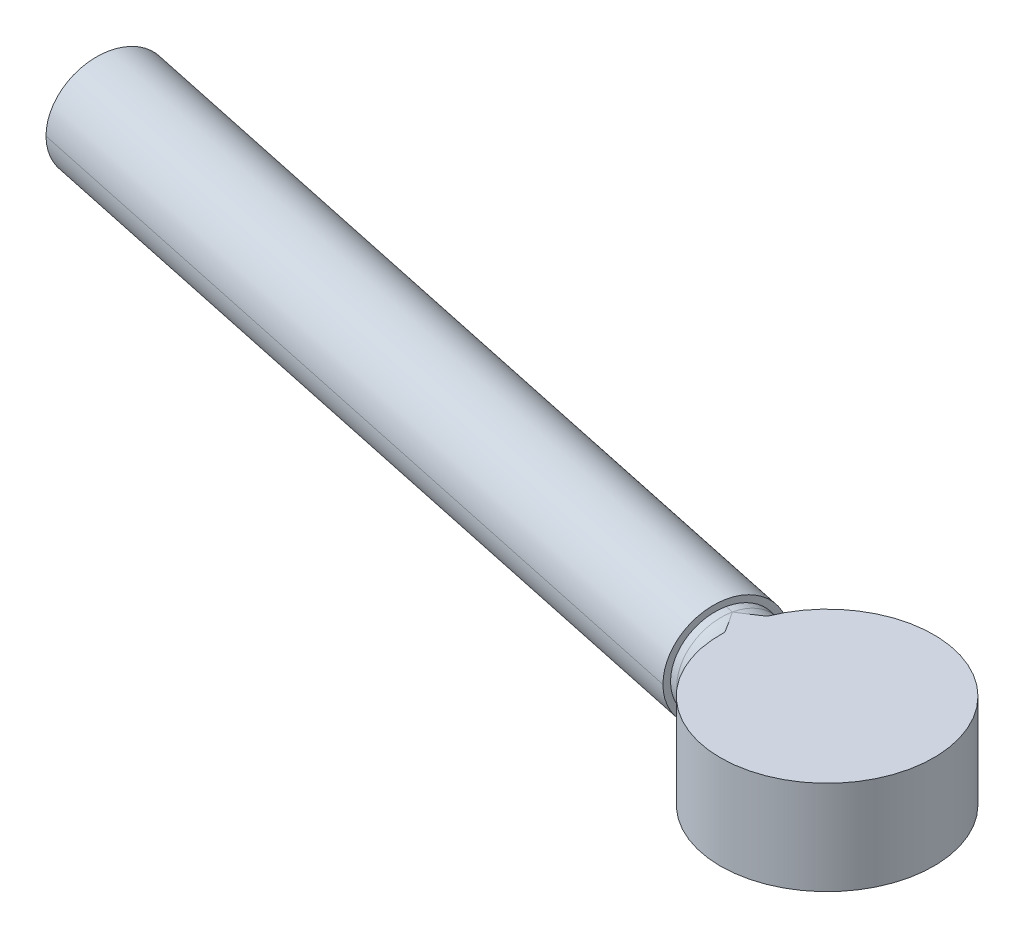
ISO-10303-21;
HEADER;
FILE_DESCRIPTION(('STEP AP214'),'2;1');
FILE_NAME('part.step','',(''),(''),'','','');
FILE_SCHEMA(('AUTOMOTIVE_DESIGN { 1 0 10303 214 1 1 1 1 }'));
ENDSEC;
DATA;
#1=APPLICATION_CONTEXT('core data for automotive mechanical design processes');
#2=APPLICATION_PROTOCOL_DEFINITION('international standard','automotive_design',2000,#1);
#3=PRODUCT_CONTEXT('',#1,'mechanical');
#4=PRODUCT('Part','Part','',(#3));
#5=PRODUCT_RELATED_PRODUCT_CATEGORY('part','',(#4));
#6=PRODUCT_DEFINITION_FORMATION('','',#4);
#7=PRODUCT_DEFINITION_CONTEXT('part definition',#1,'design');
#8=PRODUCT_DEFINITION('design','',#6,#7);
#9=PRODUCT_DEFINITION_SHAPE('','',#8);
#10=(LENGTH_UNIT() NAMED_UNIT(*) SI_UNIT(.MILLI.,.METRE.));
#11=(NAMED_UNIT(*) PLANE_ANGLE_UNIT() SI_UNIT($,.RADIAN.));
#12=(NAMED_UNIT(*) SI_UNIT($,.STERADIAN.) SOLID_ANGLE_UNIT());
#13=UNCERTAINTY_MEASURE_WITH_UNIT(LENGTH_MEASURE(1.E-05),#10,'distance_accuracy_value','');
#14=(GEOMETRIC_REPRESENTATION_CONTEXT(3) GLOBAL_UNCERTAINTY_ASSIGNED_CONTEXT((#13)) GLOBAL_UNIT_ASSIGNED_CONTEXT((#10,
#11,#12)) REPRESENTATION_CONTEXT('',''));
#15=CARTESIAN_POINT('',(0.,0.,0.));
#16=DIRECTION('',(0.,0.,1.));
#17=DIRECTION('',(1.,0.,0.));
#18=AXIS2_PLACEMENT_3D('',#15,#16,#17);
#19=CARTESIAN_POINT('',(-457.741621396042,-209.999999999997,614.766894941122));
#20=DIRECTION('',(-0.978172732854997,0.,-0.207793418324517));
#21=DIRECTION('',(-0.207793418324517,0.,0.978172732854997));
#22=AXIS2_PLACEMENT_3D('',#19,#20,#21);
#23=PLANE('',#22);
#24=CARTESIAN_POINT('',(-457.741621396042,-209.999999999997,614.766894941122));
#25=DIRECTION('',(-0.978172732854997,0.,-0.207793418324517));
#26=DIRECTION('',(-0.207793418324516,0.,0.978172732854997));
#27=AXIS2_PLACEMENT_3D('',#24,#25,#26);
#28=CIRCLE('',#27,37.5);
#29=CARTESIAN_POINT('',(-465.533874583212,-209.999999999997,651.448372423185));
#30=VERTEX_POINT('',#29);
#31=CARTESIAN_POINT('',(-449.949368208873,-209.999999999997,578.08541745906));
#32=VERTEX_POINT('',#31);
#33=EDGE_CURVE('E10',#30,#32,#28,.T.);
#34=ORIENTED_EDGE('',*,*,#33,.T.);
#35=CARTESIAN_POINT('',(-457.741621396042,-209.999999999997,614.766894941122));
#36=DIRECTION('',(-0.978172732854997,0.,-0.207793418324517));
#37=DIRECTION('',(-0.207793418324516,0.,0.978172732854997));
#38=AXIS2_PLACEMENT_3D('',#35,#36,#37);
#39=CIRCLE('',#38,37.5);
#40=EDGE_CURVE('E31',#32,#30,#39,.T.);
#41=ORIENTED_EDGE('',*,*,#40,.T.);
#42=EDGE_LOOP('',(#34,#41));
#43=FACE_BOUND('',#42,.T.);
#44=ADVANCED_FACE('F16',(#43),#23,.T.);
#45=CARTESIAN_POINT('',(-457.741621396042,-209.999999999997,614.766894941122));
#46=DIRECTION('',(0.978172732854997,0.,0.207793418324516));
#47=DIRECTION('',(0.207793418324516,0.,-0.978172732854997));
#48=AXIS2_PLACEMENT_3D('',#45,#46,#47);
#49=CYLINDRICAL_SURFACE('',#48,37.5);
#50=DIRECTION('',(0.978172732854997,0.,0.207793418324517));
#51=VECTOR('',#50,1.);
#52=CARTESIAN_POINT('',(-553.700254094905,-209.999999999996,556.04559718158));
#53=LINE('',#52,#51);
#54=CARTESIAN_POINT('',(100.76188038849,-210.000000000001,695.073111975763));
#55=VERTEX_POINT('',#54);
#56=EDGE_CURVE('E40',#32,#55,#53,.T.);
#57=ORIENTED_EDGE('',*,*,#56,.F.);
#58=ORIENTED_EDGE('',*,*,#33,.F.);
#59=DIRECTION('',(0.978172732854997,0.,0.207793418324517));
#60=VECTOR('',#59,1.);
#61=CARTESIAN_POINT('',(-569.284760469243,-209.999999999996,629.408552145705));
#62=LINE('',#61,#60);
#63=CARTESIAN_POINT('',(85.1773740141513,-210.000000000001,768.436066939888));
#64=VERTEX_POINT('',#63);
#65=EDGE_CURVE('E207',#30,#64,#62,.T.);
#66=ORIENTED_EDGE('',*,*,#65,.T.);
#67=CARTESIAN_POINT('',(92.9696272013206,-210.000000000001,731.754589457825));
#68=DIRECTION('',(0.978172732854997,0.,0.207793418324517));
#69=DIRECTION('',(-0.207793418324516,0.,0.978172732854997));
#70=AXIS2_PLACEMENT_3D('',#67,#68,#69);
#71=CIRCLE('',#70,37.5);
#72=EDGE_CURVE('E117',#55,#64,#71,.T.);
#73=ORIENTED_EDGE('',*,*,#72,.F.);
#74=EDGE_LOOP('',(#57,#58,#66,#73));
#75=FACE_BOUND('',#74,.T.);
#76=ADVANCED_FACE('F187',(#75),#49,.T.);
#77=CARTESIAN_POINT('',(-457.741621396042,-209.999999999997,614.766894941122));
#78=DIRECTION('',(0.978172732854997,0.,0.207793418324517));
#79=DIRECTION('',(0.207793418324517,0.,-0.978172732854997));
#80=AXIS2_PLACEMENT_3D('',#77,#78,#79);
#81=CYLINDRICAL_SURFACE('',#80,37.5);
#82=ORIENTED_EDGE('',*,*,#40,.F.);
#83=ORIENTED_EDGE('',*,*,#56,.T.);
#84=CARTESIAN_POINT('',(92.9696272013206,-210.000000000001,731.754589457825));
#85=DIRECTION('',(0.978172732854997,0.,0.207793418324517));
#86=DIRECTION('',(-0.207793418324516,0.,0.978172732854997));
#87=AXIS2_PLACEMENT_3D('',#84,#85,#86);
#88=CIRCLE('',#87,37.5);
#89=EDGE_CURVE('E128',#64,#55,#88,.T.);
#90=ORIENTED_EDGE('',*,*,#89,.F.);
#91=ORIENTED_EDGE('',*,*,#65,.F.);
#92=EDGE_LOOP('',(#82,#83,#90,#91));
#93=FACE_BOUND('',#92,.T.);
#94=ADVANCED_FACE('F184',(#93),#81,.T.);
#95=CARTESIAN_POINT('',(92.9696272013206,-210.000000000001,731.754589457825));
#96=DIRECTION('',(0.978172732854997,0.,0.207793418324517));
#97=DIRECTION('',(0.207793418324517,0.,-0.978172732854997));
#98=AXIS2_PLACEMENT_3D('',#95,#96,#97);
#99=PLANE('',#98);
#100=ORIENTED_EDGE('',*,*,#89,.T.);
#101=ORIENTED_EDGE('',*,*,#72,.T.);
#102=EDGE_LOOP('',(#100,#101));
#103=FACE_BOUND('',#102,.T.);
#104=CARTESIAN_POINT('',(92.9696272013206,-210.000000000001,731.754589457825));
#105=DIRECTION('',(0.978172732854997,0.,0.207793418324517));
#106=DIRECTION('',(-0.207793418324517,0.,0.978172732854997));
#107=AXIS2_PLACEMENT_3D('',#104,#105,#106);
#108=CIRCLE('',#107,33.);
#109=CARTESIAN_POINT('',(92.9696272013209,-177.000000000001,731.754589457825));
#110=VERTEX_POINT('',#109);
#111=CARTESIAN_POINT('',(92.9696272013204,-243.000000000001,731.754589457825));
#112=VERTEX_POINT('',#111);
#113=EDGE_CURVE('E113',#110,#112,#108,.T.);
#114=ORIENTED_EDGE('',*,*,#113,.F.);
#115=CARTESIAN_POINT('',(92.9696272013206,-210.000000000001,731.754589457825));
#116=DIRECTION('',(0.978172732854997,0.,0.207793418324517));
#117=DIRECTION('',(-0.207793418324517,0.,0.978172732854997));
#118=AXIS2_PLACEMENT_3D('',#115,#116,#117);
#119=CIRCLE('',#118,33.);
#120=EDGE_CURVE('E109',#112,#110,#119,.T.);
#121=ORIENTED_EDGE('',*,*,#120,.F.);
#122=EDGE_LOOP('',(#114,#121));
#123=FACE_BOUND('',#122,.T.);
#124=ADVANCED_FACE('F183',(#103,#123),#99,.T.);
#125=CARTESIAN_POINT('',(98.4827404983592,-210.000000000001,732.92574115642));
#126=DIRECTION('',(-0.978172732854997,0.,-0.207793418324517));
#127=DIRECTION('',(-0.207793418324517,0.,0.978172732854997));
#128=AXIS2_PLACEMENT_3D('',#125,#126,#127);
#129=CYLINDRICAL_SURFACE('',#128,33.);
#130=DIRECTION('',(-0.978172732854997,0.,-0.207793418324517));
#131=VECTOR('',#130,1.);
#132=CARTESIAN_POINT('',(40.2461169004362,-243.,720.554524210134));
#133=LINE('',#132,#131);
#134=CARTESIAN_POINT('',(98.482740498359,-243.000000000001,732.92574115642));
#135=VERTEX_POINT('',#134);
#136=EDGE_CURVE('E116',#135,#112,#133,.T.);
#137=ORIENTED_EDGE('',*,*,#136,.F.);
#138=CARTESIAN_POINT('',(98.4827404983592,-210.000000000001,732.92574115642));
#139=DIRECTION('',(-0.978172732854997,0.,-0.207793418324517));
#140=DIRECTION('',(0.,1.,0.));
#141=AXIS2_PLACEMENT_3D('',#138,#139,#140);
#142=CIRCLE('',#141,33.);
#143=CARTESIAN_POINT('',(98.4827404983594,-177.000000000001,732.92574115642));
#144=VERTEX_POINT('',#143);
#145=EDGE_CURVE('E86',#135,#144,#142,.T.);
#146=ORIENTED_EDGE('',*,*,#145,.T.);
#147=DIRECTION('',(-0.978172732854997,0.,-0.207793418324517));
#148=VECTOR('',#147,1.);
#149=CARTESIAN_POINT('',(40.2461169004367,-177.,720.554524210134));
#150=LINE('',#149,#148);
#151=EDGE_CURVE('E103',#144,#110,#150,.T.);
#152=ORIENTED_EDGE('',*,*,#151,.T.);
#153=ORIENTED_EDGE('',*,*,#113,.T.);
#154=EDGE_LOOP('',(#137,#146,#152,#153));
#155=FACE_BOUND('',#154,.T.);
#156=ADVANCED_FACE('F115',(#155),#129,.T.);
#157=CARTESIAN_POINT('',(98.4827404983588,-210.000000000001,732.92574115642));
#158=DIRECTION('',(-0.978172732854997,0.,-0.207793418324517));
#159=DIRECTION('',(-0.207793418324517,0.,0.978172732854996));
#160=AXIS2_PLACEMENT_3D('',#157,#158,#159);
#161=TOROIDAL_SURFACE('',#160,67.9999999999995,35.0000000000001);
#162=CARTESIAN_POINT('',(111.098486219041,-244.53681765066,729.758596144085));
#163=CARTESIAN_POINT('',(110.941768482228,-244.613444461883,730.292168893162));
#164=CARTESIAN_POINT('',(110.79058248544,-244.679027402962,730.828962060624));
#165=CARTESIAN_POINT('',(110.499691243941,-244.787855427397,731.907907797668));
#166=CARTESIAN_POINT('',(110.359986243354,-244.83110003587,732.450060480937));
#167=CARTESIAN_POINT('',(110.092514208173,-244.894990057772,733.538485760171));
#168=CARTESIAN_POINT('',(109.96474421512,-244.915641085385,734.084757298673));
#169=CARTESIAN_POINT('',(109.721427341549,-244.934259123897,735.180392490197));
#170=CARTESIAN_POINT('',(109.605880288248,-244.932226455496,735.729756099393));
#171=CARTESIAN_POINT('',(109.388052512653,-244.905585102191,736.82636816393));
#172=CARTESIAN_POINT('',(109.285680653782,-244.881142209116,737.373602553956));
#173=CARTESIAN_POINT('',(109.093367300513,-244.810043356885,738.468812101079));
#174=CARTESIAN_POINT('',(109.003425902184,-244.763387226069,739.01678726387));
#175=CARTESIAN_POINT('',(108.836042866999,-244.648103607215,740.112300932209));
#176=CARTESIAN_POINT('',(108.758600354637,-244.579477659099,740.659839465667));
#177=CARTESIAN_POINT('',(108.616185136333,-244.420615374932,741.7533541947));
#178=CARTESIAN_POINT('',(108.551212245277,-244.330379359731,742.299330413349));
#179=CARTESIAN_POINT('',(108.383713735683,-244.043074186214,743.851282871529));
#180=CARTESIAN_POINT('',(108.296136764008,-243.820344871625,744.854269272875));
#181=CARTESIAN_POINT('',(108.161979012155,-243.30596798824,746.844924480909));
#182=CARTESIAN_POINT('',(108.115396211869,-243.014323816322,747.832594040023));
#183=CARTESIAN_POINT('',(108.061066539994,-242.365895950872,749.788726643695));
#184=CARTESIAN_POINT('',(108.053368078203,-242.009031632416,750.757164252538));
#185=CARTESIAN_POINT('',(108.074287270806,-241.235006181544,752.669203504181));
#186=CARTESIAN_POINT('',(108.102909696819,-240.817837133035,753.612801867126));
#187=CARTESIAN_POINT('',(108.211394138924,-239.751974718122,755.839135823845));
#188=CARTESIAN_POINT('',(108.307033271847,-239.076929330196,757.10855893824));
#189=CARTESIAN_POINT('',(108.554477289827,-237.630940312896,759.585890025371));
#190=CARTESIAN_POINT('',(108.706302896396,-236.859961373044,760.793775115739));
#191=CARTESIAN_POINT('',(109.057483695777,-235.232479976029,763.145590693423));
#192=CARTESIAN_POINT('',(109.256908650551,-234.375853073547,764.289424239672));
#193=CARTESIAN_POINT('',(109.69451192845,-232.588287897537,766.509095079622));
#194=CARTESIAN_POINT('',(109.932685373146,-231.657358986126,767.584940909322));
#195=CARTESIAN_POINT('',(110.418630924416,-229.809779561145,769.581786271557));
#196=CARTESIAN_POINT('',(110.663970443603,-228.898343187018,770.508228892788));
#197=CARTESIAN_POINT('',(111.174537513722,-227.02598695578,772.303736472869));
#198=CARTESIAN_POINT('',(111.439765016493,-226.0650672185,773.172801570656));
#199=CARTESIAN_POINT('',(111.984261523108,-224.099948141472,774.853012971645));
#200=CARTESIAN_POINT('',(112.263512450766,-223.095804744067,775.664230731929));
#201=CARTESIAN_POINT('',(112.831197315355,-221.047461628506,777.230593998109));
#202=CARTESIAN_POINT('',(113.119630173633,-220.003266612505,777.985746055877));
#203=CARTESIAN_POINT('',(113.704727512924,-217.864301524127,779.450522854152));
#204=CARTESIAN_POINT('',(114.001450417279,-216.769044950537,780.15941262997));
#205=CARTESIAN_POINT('',(114.594537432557,-214.544756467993,781.521151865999));
#206=CARTESIAN_POINT('',(114.890901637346,-213.415737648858,782.174022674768));
#207=CARTESIAN_POINT('',(115.373606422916,-211.53629388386,783.200856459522));
#208=CARTESIAN_POINT('',(115.561354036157,-210.795024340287,783.590997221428));
#209=CARTESIAN_POINT('',(115.751498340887,-210.031801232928,783.977935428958));
#210=CARTESIAN_POINT('',(115.755457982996,-210.015901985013,783.985989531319));
#211=CARTESIAN_POINT('',(115.759416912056,-210.000000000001,783.994038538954));
#212=B_SPLINE_CURVE_WITH_KNOTS('',3,(#162,#163,#164,#165,#166,#167,#168,#169,#170,#171,#172,
#173,#174,#175,#176,#177,#178,#179,#180,#181,#182,#183,#184,#185,#186,#187,#188,#189,#190,#191,
#192,#193,#194,#195,#196,#197,#198,#199,#200,#201,#202,#203,#204,#205,#206,#207,#208,#209,#210,
#211),.UNSPECIFIED.,.F.,.F.,(4,2,2,2,2,2,2,2,2,2,2,2,2,2,2,2,2,2,2,2,2,2,2,2,4),(0.,
1.68396774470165,3.36797128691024,5.05155628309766,6.73511747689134,8.40632324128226,
10.0775419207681,11.7486434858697,13.419720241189,16.509504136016,19.5991357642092,
22.6926129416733,25.7864965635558,30.102820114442,34.4207371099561,38.7450217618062,
43.0687624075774,47.0340620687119,50.9993521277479,54.9596559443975,58.9194962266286,
62.9317531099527,66.9424740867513,69.5174274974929,69.5721997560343),.UNSPECIFIED.);
#213=CARTESIAN_POINT('',(115.759416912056,-210.000000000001,783.994038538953));
#214=VERTEX_POINT('',#213);
#215=CARTESIAN_POINT('',(108.121452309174,-242.999999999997,747.840543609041));
#216=VERTEX_POINT('',#215);
#217=EDGE_CURVE('E21',#214,#216,#212,.F.);
#218=ORIENTED_EDGE('',*,*,#217,.F.);
#219=CARTESIAN_POINT('',(108.121452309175,-176.999999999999,747.840543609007));
#220=CARTESIAN_POINT('',(108.099957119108,-177.162193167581,748.36819737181));
#221=CARTESIAN_POINT('',(108.084168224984,-177.333903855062,748.893127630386));
#222=CARTESIAN_POINT('',(108.063609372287,-177.695642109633,749.936790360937));
#223=CARTESIAN_POINT('',(108.058838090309,-177.885667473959,750.455523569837));
#224=CARTESIAN_POINT('',(108.059915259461,-178.283145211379,751.485621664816));
#225=CARTESIAN_POINT('',(108.065752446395,-178.49057887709,751.996993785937));
#226=CARTESIAN_POINT('',(108.087583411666,-178.922318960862,753.01232849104));
#227=CARTESIAN_POINT('',(108.103577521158,-179.146625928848,753.516290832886));
#228=CARTESIAN_POINT('',(108.165861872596,-179.840967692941,755.010199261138));
#229=CARTESIAN_POINT('',(108.226472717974,-180.334913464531,755.988584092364));
#230=CARTESIAN_POINT('',(108.382227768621,-181.381176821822,757.910946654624));
#231=CARTESIAN_POINT('',(108.477385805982,-181.93351772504,758.854910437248));
#232=CARTESIAN_POINT('',(108.751839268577,-183.371681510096,761.154415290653));
#233=CARTESIAN_POINT('',(108.949563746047,-184.289467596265,762.487898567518));
#234=CARTESIAN_POINT('',(109.399782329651,-186.226214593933,765.069417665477));
#235=CARTESIAN_POINT('',(109.652297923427,-187.245215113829,766.317419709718));
#236=CARTESIAN_POINT('',(110.200819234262,-189.373973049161,768.729711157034));
#237=CARTESIAN_POINT('',(110.496952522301,-190.48399230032,769.89373955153));
#238=CARTESIAN_POINT('',(111.120753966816,-192.780423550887,772.133638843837));
#239=CARTESIAN_POINT('',(111.448414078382,-193.966816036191,773.209532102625));
#240=CARTESIAN_POINT('',(112.20678861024,-196.702140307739,775.52441459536));
#241=CARTESIAN_POINT('',(112.643260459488,-198.269354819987,776.739911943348));
#242=CARTESIAN_POINT('',(113.529865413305,-201.490134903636,779.037815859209));
#243=CARTESIAN_POINT('',(113.97997245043,-203.143539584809,780.120458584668));
#244=CARTESIAN_POINT('',(114.613399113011,-205.530440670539,781.557696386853));
#245=CARTESIAN_POINT('',(114.797702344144,-206.232152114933,781.965514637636));
#246=CARTESIAN_POINT('',(115.164875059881,-207.647975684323,782.759802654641));
#247=CARTESIAN_POINT('',(115.347744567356,-208.362087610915,783.146272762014));
#248=CARTESIAN_POINT('',(115.602294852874,-209.371178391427,783.673084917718));
#249=CARTESIAN_POINT('',(115.675034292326,-209.661278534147,783.822333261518));
#250=CARTESIAN_POINT('',(115.751498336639,-209.968198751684,783.977935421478));
#251=CARTESIAN_POINT('',(115.755457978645,-209.984097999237,783.985989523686));
#252=CARTESIAN_POINT('',(115.759416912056,-210.000000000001,783.994038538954));
#253=B_SPLINE_CURVE_WITH_KNOTS('',3,(#219,#220,#221,#222,#223,#224,#225,#226,#227,#228,#229,
#230,#231,#232,#233,#234,#235,#236,#237,#238,#239,#240,#241,#242,#243,#244,#245,#246,#247,#248,
#249,#250,#251,#252),.UNSPECIFIED.,.F.,.F.,(4,2,2,2,2,2,2,2,2,2,2,2,2,2,2,2,4),(0.,
1.65715034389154,3.31410162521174,4.96929456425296,6.62454147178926,9.91443625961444,
13.2056497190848,18.090675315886,22.9776201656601,27.8791528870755,32.7794381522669,
38.8649413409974,44.9394654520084,47.4360349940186,49.9325646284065,50.9353032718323,
50.9900755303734),.UNSPECIFIED.);
#254=CARTESIAN_POINT('',(108.121452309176,-177.,747.840543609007));
#255=VERTEX_POINT('',#254);
#256=EDGE_CURVE('E75',#255,#214,#253,.T.);
#257=ORIENTED_EDGE('',*,*,#256,.F.);
#258=CARTESIAN_POINT('',(98.4827404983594,-177.000000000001,732.92574115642));
#259=CARTESIAN_POINT('',(98.8945235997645,-177.000000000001,733.539704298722));
#260=CARTESIAN_POINT('',(99.307724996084,-177.000000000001,734.155781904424));
#261=CARTESIAN_POINT('',(100.131721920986,-177.000000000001,735.386479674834));
#262=CARTESIAN_POINT('',(101.366181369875,-177.000000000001,737.233429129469));
#263=CARTESIAN_POINT('',(102.591422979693,-177.000000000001,739.085796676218));
#264=CARTESIAN_POINT('',(105.01737759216,-177.000000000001,742.804949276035));
#265=CARTESIAN_POINT('',(106.601956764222,-177.000000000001,745.303618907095));
#266=CARTESIAN_POINT('',(108.121452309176,-177.000000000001,747.840543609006));
#267=B_SPLINE_CURVE_WITH_KNOTS('',3,(#258,#259,#260,#261,#262,#263,#264,#265,#266),
.UNSPECIFIED.,.F.,.F.,(4,2,1,2,4),(-3.74165738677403E-05,0.00218038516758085,
0.00439818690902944,0.00883379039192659,0.0177049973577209),.UNSPECIFIED.);
#268=EDGE_CURVE('E81',#144,#255,#267,.T.);
#269=ORIENTED_EDGE('',*,*,#268,.F.);
#270=ORIENTED_EDGE('',*,*,#145,.F.);
#271=CARTESIAN_POINT('',(98.482740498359,-243.000000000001,732.92574115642));
#272=CARTESIAN_POINT('',(98.8945235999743,-243.000000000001,733.539704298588));
#273=CARTESIAN_POINT('',(99.3077249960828,-243.000000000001,734.155781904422));
#274=CARTESIAN_POINT('',(100.131721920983,-243.000000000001,735.386479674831));
#275=CARTESIAN_POINT('',(101.366181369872,-243.000000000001,737.233429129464));
#276=CARTESIAN_POINT('',(102.591422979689,-243.000000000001,739.085796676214));
#277=CARTESIAN_POINT('',(105.017377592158,-243.000000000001,742.804949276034));
#278=CARTESIAN_POINT('',(106.601956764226,-243.000000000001,745.303618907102));
#279=CARTESIAN_POINT('',(108.121452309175,-243.000000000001,747.840543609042));
#280=B_SPLINE_CURVE_WITH_KNOTS('',3,(#271,#272,#273,#274,#275,#276,#277,#278,#279),
.UNSPECIFIED.,.F.,.F.,(4,2,1,2,4),(-3.74165738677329E-05,0.00218038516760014,
0.00439818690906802,0.00883379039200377,0.0177049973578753),.UNSPECIFIED.);
#281=EDGE_CURVE('E123',#135,#216,#280,.T.);
#282=ORIENTED_EDGE('',*,*,#281,.T.);
#283=EDGE_LOOP('',(#218,#257,#269,#270,#282));
#284=FACE_BOUND('',#283,.T.);
#285=ADVANCED_FACE('F83',(#284),#161,.F.);
#286=CARTESIAN_POINT('',(270.182966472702,-243.000000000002,846.073627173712));
#287=DIRECTION('',(0.,-1.,0.));
#288=DIRECTION('',(1.,0.,0.));
#289=AXIS2_PLACEMENT_3D('',#286,#287,#288);
#290=PLANE('',#289);
#291=CARTESIAN_POINT('',(113.352191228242,-243.000000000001,723.217212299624));
#292=CARTESIAN_POINT('',(110.932596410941,-243.000000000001,724.917371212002));
#293=CARTESIAN_POINT('',(108.469088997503,-243.000000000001,726.556120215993));
#294=CARTESIAN_POINT('',(104.740709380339,-243.000000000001,728.967928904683));
#295=CARTESIAN_POINT('',(103.492399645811,-243.000000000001,729.764150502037));
#296=CARTESIAN_POINT('',(101.615788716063,-243.000000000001,730.952684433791));
#297=CARTESIAN_POINT('',(100.676447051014,-243.000000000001,731.545502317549));
#298=CARTESIAN_POINT('',(99.7363278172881,-243.000000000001,732.137232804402));
#299=CARTESIAN_POINT('',(99.1094952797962,-243.000000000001,732.531598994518));
#300=CARTESIAN_POINT('',(98.7945839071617,-243.000000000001,732.729634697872));
#301=CARTESIAN_POINT('',(98.482740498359,-243.000000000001,732.92574115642));
#302=B_SPLINE_CURVE_WITH_KNOTS('',3,(#291,#292,#293,#294,#295,#296,#297,#298,#299,#300,#301),
.UNSPECIFIED.,.F.,.F.,(4,2,2,1,2,4),(0.0811150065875,0.0899561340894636,0.0943766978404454,
0.0965869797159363,0.0976921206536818,0.0987972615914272),.UNSPECIFIED.);
#303=CARTESIAN_POINT('',(113.352191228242,-243.000000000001,723.217212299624));
#304=VERTEX_POINT('',#303);
#305=EDGE_CURVE('E91',#304,#135,#302,.T.);
#306=ORIENTED_EDGE('',*,*,#305,.F.);
#307=CARTESIAN_POINT('',(183.059335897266,-243.000000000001,750.892363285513));
#308=DIRECTION('',(0.,-1.,0.));
#309=DIRECTION('',(-0.978172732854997,0.,-0.207793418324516));
#310=AXIS2_PLACEMENT_3D('',#307,#308,#309);
#311=CIRCLE('',#310,75.);
#312=EDGE_CURVE('E120',#304,#216,#311,.T.);
#313=ORIENTED_EDGE('',*,*,#312,.T.);
#314=ORIENTED_EDGE('',*,*,#281,.F.);
#315=EDGE_LOOP('',(#306,#313,#314));
#316=FACE_BOUND('',#315,.T.);
#317=ADVANCED_FACE('F179',(#316),#290,.T.);
#318=CARTESIAN_POINT('',(98.4827404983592,-210.000000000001,732.92574115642));
#319=DIRECTION('',(-0.978172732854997,0.,-0.207793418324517));
#320=DIRECTION('',(-0.207793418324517,0.,0.978172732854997));
#321=AXIS2_PLACEMENT_3D('',#318,#319,#320);
#322=CYLINDRICAL_SURFACE('',#321,33.);
#323=CARTESIAN_POINT('',(98.4827404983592,-210.000000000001,732.92574115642));
#324=DIRECTION('',(-0.978172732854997,0.,-0.207793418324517));
#325=DIRECTION('',(0.,1.,0.));
#326=AXIS2_PLACEMENT_3D('',#323,#324,#325);
#327=CIRCLE('',#326,33.);
#328=EDGE_CURVE('E106',#144,#135,#327,.T.);
#329=ORIENTED_EDGE('',*,*,#328,.T.);
#330=ORIENTED_EDGE('',*,*,#136,.T.);
#331=ORIENTED_EDGE('',*,*,#120,.T.);
#332=ORIENTED_EDGE('',*,*,#151,.F.);
#333=EDGE_LOOP('',(#329,#330,#331,#332));
#334=FACE_BOUND('',#333,.T.);
#335=ADVANCED_FACE('F104',(#334),#322,.T.);
#336=CARTESIAN_POINT('',(183.059335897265,-177.000000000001,750.892363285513));
#337=DIRECTION('',(0.,-1.,0.));
#338=DIRECTION('',(1.,0.,0.));
#339=AXIS2_PLACEMENT_3D('',#336,#337,#338);
#340=CYLINDRICAL_SURFACE('',#339,75.);
#341=CARTESIAN_POINT('',(113.352191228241,-243.000000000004,723.217212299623));
#342=CARTESIAN_POINT('',(113.547051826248,-242.837806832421,722.726386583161));
#343=CARTESIAN_POINT('',(113.746018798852,-242.666096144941,722.240368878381));
#344=CARTESIAN_POINT('',(114.151500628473,-242.30435789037,721.278475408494));
#345=CARTESIAN_POINT('',(114.358014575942,-242.114332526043,720.802598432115));
#346=CARTESIAN_POINT('',(114.777749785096,-241.716854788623,719.86189359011));
#347=CARTESIAN_POINT('',(114.990963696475,-241.509421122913,719.397054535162));
#348=CARTESIAN_POINT('',(115.423658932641,-241.077681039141,718.478274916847));
#349=CARTESIAN_POINT('',(115.643140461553,-240.853374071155,718.024334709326));
#350=CARTESIAN_POINT('',(116.307343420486,-240.159032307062,716.684754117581));
#351=CARTESIAN_POINT('',(116.760448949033,-239.665086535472,715.81549815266));
#352=CARTESIAN_POINT('',(117.684224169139,-238.618823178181,714.122460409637));
#353=CARTESIAN_POINT('',(118.154900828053,-238.066482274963,713.298696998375));
#354=CARTESIAN_POINT('',(119.340438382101,-236.628318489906,711.30933831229));
#355=CARTESIAN_POINT('',(120.063170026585,-235.710532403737,710.171387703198));
#356=CARTESIAN_POINT('',(121.523937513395,-233.773785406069,707.995819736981));
#357=CARTESIAN_POINT('',(122.261979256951,-232.754784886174,706.958241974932));
#358=CARTESIAN_POINT('',(123.743766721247,-230.626026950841,704.97724940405));
#359=CARTESIAN_POINT('',(124.487522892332,-229.516007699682,704.034124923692));
#360=CARTESIAN_POINT('',(125.968009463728,-227.219576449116,702.241239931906));
#361=CARTESIAN_POINT('',(126.704741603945,-226.033183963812,701.391455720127));
#362=CARTESIAN_POINT('',(128.338661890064,-223.297859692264,699.584768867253));
#363=CARTESIAN_POINT('',(129.231560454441,-221.730645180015,698.651669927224));
#364=CARTESIAN_POINT('',(130.975735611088,-218.509865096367,696.912623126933));
#365=CARTESIAN_POINT('',(131.827084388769,-216.856460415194,696.106448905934));
#366=CARTESIAN_POINT('',(132.990070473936,-214.469559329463,695.050823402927));
#367=CARTESIAN_POINT('',(133.324242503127,-213.767847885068,694.753144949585));
#368=CARTESIAN_POINT('',(133.982598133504,-212.352024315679,694.176710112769));
#369=CARTESIAN_POINT('',(134.306781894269,-211.63791238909,693.8979534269));
#370=CARTESIAN_POINT('',(134.753507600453,-210.628821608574,693.520113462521));
#371=CARTESIAN_POINT('',(134.880637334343,-210.338721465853,693.413323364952));
#372=CARTESIAN_POINT('',(135.013752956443,-210.031801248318,693.302242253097));
#373=CARTESIAN_POINT('',(135.020644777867,-210.015902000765,693.296493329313));
#374=CARTESIAN_POINT('',(135.027533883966,-210.000000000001,693.290748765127));
#375=B_SPLINE_CURVE_WITH_KNOTS('',3,(#341,#342,#343,#344,#345,#346,#347,#348,#349,#350,#351,
#352,#353,#354,#355,#356,#357,#358,#359,#360,#361,#362,#363,#364,#365,#366,#367,#368,#369,#370,
#371,#372,#373,#374),.UNSPECIFIED.,.F.,.F.,(4,2,2,2,2,2,2,2,2,2,2,2,2,2,2,2,4),(0.,
1.65715034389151,3.3141016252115,4.96929456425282,6.624541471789,9.91443625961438,
13.2056497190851,18.0906753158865,22.9776201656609,27.8791528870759,32.7794381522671,
38.8649413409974,44.9394654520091,47.4360349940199,49.9325646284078,50.9353032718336,
50.9900755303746),.UNSPECIFIED.);
#376=CARTESIAN_POINT('',(135.027533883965,-210.000000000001,693.290748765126));
#377=VERTEX_POINT('',#376);
#378=EDGE_CURVE('E153',#304,#377,#375,.T.);
#379=ORIENTED_EDGE('',*,*,#378,.T.);
#380=CARTESIAN_POINT('',(109.143577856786,-175.17243471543,738.185644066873));
#381=CARTESIAN_POINT('',(109.238665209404,-175.132898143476,737.63242044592));
#382=CARTESIAN_POINT('',(109.340130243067,-175.104715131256,737.079480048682));
#383=CARTESIAN_POINT('',(109.555602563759,-175.071111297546,735.97536250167));
#384=CARTESIAN_POINT('',(109.669609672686,-175.065690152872,735.424185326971));
#385=CARTESIAN_POINT('',(109.909894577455,-175.077660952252,734.325055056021));
#386=CARTESIAN_POINT('',(110.036166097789,-175.095041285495,733.777100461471));
#387=CARTESIAN_POINT('',(110.300706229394,-175.152494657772,732.685296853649));
#388=CARTESIAN_POINT('',(110.438974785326,-175.192567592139,732.141447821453));
#389=CARTESIAN_POINT('',(110.725936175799,-175.294776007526,731.063397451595));
#390=CARTESIAN_POINT('',(110.874534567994,-175.356728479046,730.529153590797));
#391=CARTESIAN_POINT('',(111.182703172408,-175.502439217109,729.466780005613));
#392=CARTESIAN_POINT('',(111.342274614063,-175.586199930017,728.938650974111));
#393=CARTESIAN_POINT('',(111.671845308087,-175.775102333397,727.889571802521));
#394=CARTESIAN_POINT('',(111.841843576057,-175.880242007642,727.368620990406));
#395=CARTESIAN_POINT('',(112.19171449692,-176.111399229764,726.334711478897));
#396=CARTESIAN_POINT('',(112.371588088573,-176.23741876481,725.821753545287));
#397=CARTESIAN_POINT('',(112.899026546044,-176.626696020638,724.368015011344));
#398=CARTESIAN_POINT('',(113.258013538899,-176.914910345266,723.437913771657));
#399=CARTESIAN_POINT('',(114.003798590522,-177.557212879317,721.612585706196));
#400=CARTESIAN_POINT('',(114.390594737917,-177.911296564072,720.717356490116));
#401=CARTESIAN_POINT('',(115.188489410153,-178.681385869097,718.963094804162));
#402=CARTESIAN_POINT('',(115.599628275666,-179.097496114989,718.104126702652));
#403=CARTESIAN_POINT('',(116.441381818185,-179.98638324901,716.426004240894));
#404=CARTESIAN_POINT('',(116.871999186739,-180.45916798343,715.606855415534));
#405=CARTESIAN_POINT('',(117.95592189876,-181.69255101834,713.631859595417));
#406=CARTESIAN_POINT('',(118.618285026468,-182.483568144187,712.499860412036));
#407=CARTESIAN_POINT('',(119.964552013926,-184.16429719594,710.325314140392));
#408=CARTESIAN_POINT('',(120.64846514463,-185.054052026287,709.282806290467));
#409=CARTESIAN_POINT('',(122.027837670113,-186.92070129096,707.284659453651));
#410=CARTESIAN_POINT('',(122.723310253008,-187.897701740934,706.329129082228));
#411=CARTESIAN_POINT('',(124.115423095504,-189.926953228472,704.503432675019));
#412=CARTESIAN_POINT('',(124.812063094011,-190.979189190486,703.633249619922));
#413=CARTESIAN_POINT('',(126.039986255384,-192.902033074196,702.163630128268));
#414=CARTESIAN_POINT('',(126.572707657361,-193.759256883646,701.547739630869));
#415=CARTESIAN_POINT('',(127.630567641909,-195.509705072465,700.362345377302));
#416=CARTESIAN_POINT('',(128.155706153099,-196.402929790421,699.792842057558));
#417=CARTESIAN_POINT('',(129.194418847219,-198.220894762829,698.699081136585));
#418=CARTESIAN_POINT('',(129.70800877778,-199.145587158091,698.174758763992));
#419=CARTESIAN_POINT('',(130.721414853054,-201.02495218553,697.16851524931));
#420=CARTESIAN_POINT('',(131.221232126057,-201.979622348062,696.686590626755));
#421=CARTESIAN_POINT('',(132.167826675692,-203.844701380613,695.797499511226));
#422=CARTESIAN_POINT('',(132.615787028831,-204.7531352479,695.38743916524));
#423=CARTESIAN_POINT('',(133.495331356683,-206.591864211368,694.600644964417));
#424=CARTESIAN_POINT('',(133.926918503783,-207.522155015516,694.223904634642));
#425=CARTESIAN_POINT('',(134.571074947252,-208.956416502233,693.673716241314));
#426=CARTESIAN_POINT('',(134.790305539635,-209.453003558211,693.48870261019));
#427=CARTESIAN_POINT('',(135.013752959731,-209.968198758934,693.302242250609));
#428=CARTESIAN_POINT('',(135.020644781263,-209.984098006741,693.296493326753));
#429=CARTESIAN_POINT('',(135.027533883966,-210.000000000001,693.290748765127));
#430=B_SPLINE_CURVE_WITH_KNOTS('',3,(#380,#381,#382,#383,#384,#385,#386,#387,#388,#389,#390,
#391,#392,#393,#394,#395,#396,#397,#398,#399,#400,#401,#402,#403,#404,#405,#406,#407,#408,#409,
#410,#411,#412,#413,#414,#415,#416,#417,#418,#419,#420,#421,#422,#423,#424,#425,#426,#427,#428,
#429),.UNSPECIFIED.,.F.,.F.,(4,2,2,2,2,2,2,2,2,2,2,2,2,2,2,2,2,2,2,2,2,2,2,2,4),(0.,
1.68803190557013,3.37603984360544,5.06318855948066,6.75032949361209,8.4236802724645,
10.0972188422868,11.7705996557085,13.4441398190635,16.554058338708,19.6637633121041,
22.7787743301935,25.8942171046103,30.4821167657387,35.0720178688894,39.6675742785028,
44.262212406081,47.8077974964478,51.3534159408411,54.8938637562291,58.4340206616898,
61.7113845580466,64.9881101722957,66.708471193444,66.7632434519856),.UNSPECIFIED.);
#431=CARTESIAN_POINT('',(113.352191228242,-177.000000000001,723.217212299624));
#432=VERTEX_POINT('',#431);
#433=EDGE_CURVE('E162',#377,#432,#430,.F.);
#434=ORIENTED_EDGE('',*,*,#433,.T.);
#435=CARTESIAN_POINT('',(183.059335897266,-177.000000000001,750.892363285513));
#436=DIRECTION('',(0.,1.,0.));
#437=DIRECTION('',(-0.978172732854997,0.,-0.207793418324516));
#438=AXIS2_PLACEMENT_3D('',#435,#436,#437);
#439=CIRCLE('',#438,75.);
#440=EDGE_CURVE('E95',#255,#432,#439,.T.);
#441=ORIENTED_EDGE('',*,*,#440,.F.);
#442=ORIENTED_EDGE('',*,*,#256,.T.);
#443=ORIENTED_EDGE('',*,*,#217,.T.);
#444=ORIENTED_EDGE('',*,*,#312,.F.);
#445=EDGE_LOOP('',(#379,#434,#441,#442,#443,#444));
#446=FACE_BOUND('',#445,.T.);
#447=ADVANCED_FACE('F166',(#446),#340,.T.);
#448=CARTESIAN_POINT('',(270.182966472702,-177.000000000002,846.073627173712));
#449=DIRECTION('',(0.,1.,0.));
#450=DIRECTION('',(0.,0.,1.));
#451=AXIS2_PLACEMENT_3D('',#448,#449,#450);
#452=PLANE('',#451);
#453=ORIENTED_EDGE('',*,*,#440,.T.);
#454=CARTESIAN_POINT('',(113.352191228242,-177.000000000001,723.217212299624));
#455=CARTESIAN_POINT('',(110.932596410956,-177.000000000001,724.917371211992));
#456=CARTESIAN_POINT('',(108.469088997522,-177.000000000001,726.556120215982));
#457=CARTESIAN_POINT('',(104.740709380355,-177.000000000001,728.967928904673));
#458=CARTESIAN_POINT('',(103.492399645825,-177.000000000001,729.764150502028));
#459=CARTESIAN_POINT('',(101.615788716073,-177.000000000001,730.952684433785));
#460=CARTESIAN_POINT('',(100.676447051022,-177.000000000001,731.545502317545));
#461=CARTESIAN_POINT('',(99.7363278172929,-177.000000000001,732.137232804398));
#462=CARTESIAN_POINT('',(99.1094952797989,-177.000000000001,732.531598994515));
#463=CARTESIAN_POINT('',(98.794583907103,-177.000000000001,732.729634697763));
#464=CARTESIAN_POINT('',(98.4827404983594,-177.000000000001,732.92574115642));
#465=B_SPLINE_CURVE_WITH_KNOTS('',3,(#454,#455,#456,#457,#458,#459,#460,#461,#462,#463,#464),
.UNSPECIFIED.,.F.,.F.,(4,2,2,1,2,4),(0.0811150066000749,0.0899561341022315,0.0943766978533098,
0.096586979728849,0.0976921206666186,0.0987972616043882),.UNSPECIFIED.);
#466=EDGE_CURVE('E90',#432,#144,#465,.T.);
#467=ORIENTED_EDGE('',*,*,#466,.T.);
#468=ORIENTED_EDGE('',*,*,#268,.T.);
#469=EDGE_LOOP('',(#453,#467,#468));
#470=FACE_BOUND('',#469,.T.);
#471=ADVANCED_FACE('F94',(#470),#452,.T.);
#472=CARTESIAN_POINT('',(98.4827404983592,-210.000000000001,732.92574115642));
#473=DIRECTION('',(-0.978172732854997,0.,-0.207793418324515));
#474=DIRECTION('',(-0.207793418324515,0.,0.978172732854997));
#475=AXIS2_PLACEMENT_3D('',#472,#473,#474);
#476=TOROIDAL_SURFACE('',#475,67.9999999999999,35.);
#477=ORIENTED_EDGE('',*,*,#433,.F.);
#478=ORIENTED_EDGE('',*,*,#378,.F.);
#479=ORIENTED_EDGE('',*,*,#305,.T.);
#480=ORIENTED_EDGE('',*,*,#328,.F.);
#481=ORIENTED_EDGE('',*,*,#466,.F.);
#482=EDGE_LOOP('',(#477,#478,#479,#480,#481));
#483=FACE_BOUND('',#482,.T.);
#484=ADVANCED_FACE('F18',(#483),#476,.F.);
#485=CLOSED_SHELL('',(#44,#76,#94,#124,#156,#285,#317,#335,#447,#471,#484));
#486=MANIFOLD_SOLID_BREP('B1',#485);
#487=ADVANCED_BREP_SHAPE_REPRESENTATION('',(#18,#486),#14);
#488=SHAPE_DEFINITION_REPRESENTATION(#9,#487);
ENDSEC;
END-ISO-10303-21;
